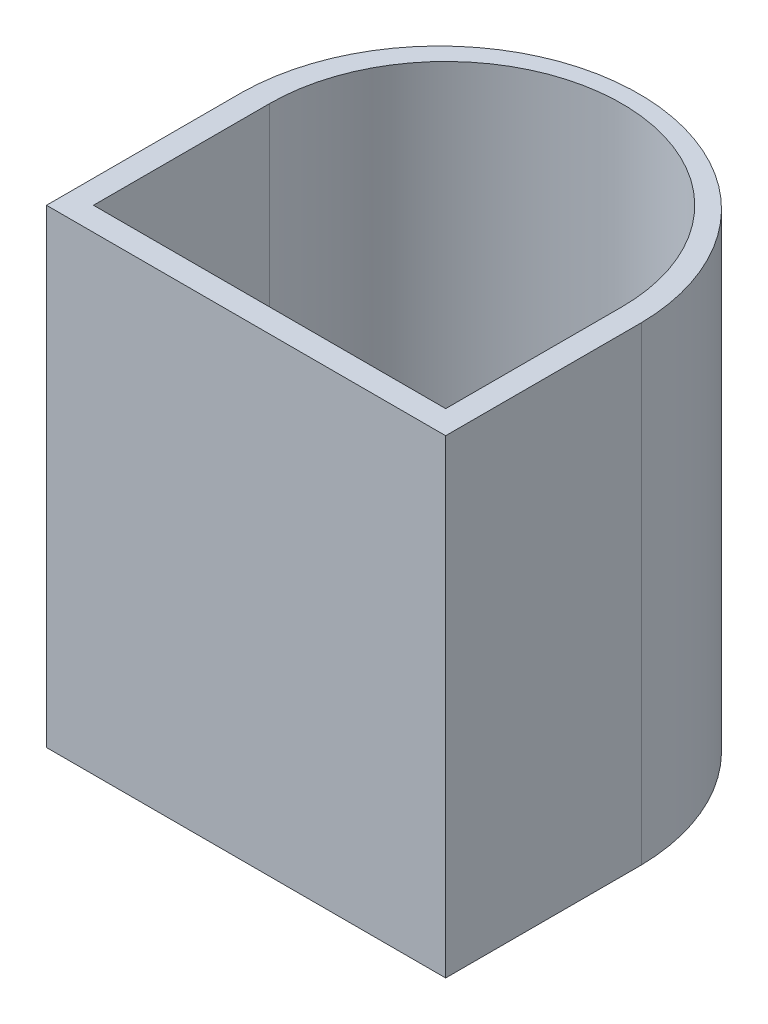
ISO-10303-21;
HEADER;
FILE_DESCRIPTION(('STEP AP214'),'2;1');
FILE_NAME('part.step','',(''),(''),'','','');
FILE_SCHEMA(('AUTOMOTIVE_DESIGN { 1 0 10303 214 1 1 1 1 }'));
ENDSEC;
DATA;
#1=APPLICATION_CONTEXT('core data for automotive mechanical design processes');
#2=APPLICATION_PROTOCOL_DEFINITION('international standard','automotive_design',2000,#1);
#3=PRODUCT_CONTEXT('',#1,'mechanical');
#4=PRODUCT('Part','Part','',(#3));
#5=PRODUCT_RELATED_PRODUCT_CATEGORY('part','',(#4));
#6=PRODUCT_DEFINITION_FORMATION('','',#4);
#7=PRODUCT_DEFINITION_CONTEXT('part definition',#1,'design');
#8=PRODUCT_DEFINITION('design','',#6,#7);
#9=PRODUCT_DEFINITION_SHAPE('','',#8);
#10=(LENGTH_UNIT() NAMED_UNIT(*) SI_UNIT(.MILLI.,.METRE.));
#11=(NAMED_UNIT(*) PLANE_ANGLE_UNIT() SI_UNIT($,.RADIAN.));
#12=(NAMED_UNIT(*) SI_UNIT($,.STERADIAN.) SOLID_ANGLE_UNIT());
#13=UNCERTAINTY_MEASURE_WITH_UNIT(LENGTH_MEASURE(1.E-05),#10,'distance_accuracy_value','');
#14=(GEOMETRIC_REPRESENTATION_CONTEXT(3) GLOBAL_UNCERTAINTY_ASSIGNED_CONTEXT((#13)) GLOBAL_UNIT_ASSIGNED_CONTEXT((#10,
#11,#12)) REPRESENTATION_CONTEXT('',''));
#15=CARTESIAN_POINT('',(0.,0.,0.));
#16=DIRECTION('',(0.,0.,1.));
#17=DIRECTION('',(1.,0.,0.));
#18=AXIS2_PLACEMENT_3D('',#15,#16,#17);
#19=CARTESIAN_POINT('',(14.998515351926,-2.,-14.4524035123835));
#20=DIRECTION('',(0.,1.,0.));
#21=DIRECTION('',(0.,0.,1.));
#22=AXIS2_PLACEMENT_3D('',#19,#20,#21);
#23=CYLINDRICAL_SURFACE('',#22,17.);
#24=DIRECTION('',(0.,1.,0.));
#25=VECTOR('',#24,1.);
#26=CARTESIAN_POINT('',(-2.,-2.,-14.6770717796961));
#27=LINE('',#26,#25);
#28=CARTESIAN_POINT('',(-2.,-2.,-14.6770717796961));
#29=VERTEX_POINT('',#28);
#30=CARTESIAN_POINT('',(-2.,38.,-14.6770717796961));
#31=VERTEX_POINT('',#30);
#32=EDGE_CURVE('E37',#29,#31,#27,.T.);
#33=ORIENTED_EDGE('',*,*,#32,.T.);
#34=CARTESIAN_POINT('',(14.998515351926,38.,-14.4524035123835));
#35=DIRECTION('',(0.,1.,0.));
#36=DIRECTION('',(0.,0.,1.));
#37=AXIS2_PLACEMENT_3D('',#34,#35,#36);
#38=CIRCLE('',#37,17.);
#39=CARTESIAN_POINT('',(31.9970307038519,38.,-14.6770717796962));
#40=VERTEX_POINT('',#39);
#41=EDGE_CURVE('E191',#31,#40,#38,.F.);
#42=ORIENTED_EDGE('',*,*,#41,.T.);
#43=DIRECTION('',(0.,1.,0.));
#44=VECTOR('',#43,1.);
#45=CARTESIAN_POINT('',(31.9970307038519,-2.,-14.6770717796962));
#46=LINE('',#45,#44);
#47=CARTESIAN_POINT('',(31.9970307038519,-2.,-14.6770717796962));
#48=VERTEX_POINT('',#47);
#49=EDGE_CURVE('E11',#48,#40,#46,.T.);
#50=ORIENTED_EDGE('',*,*,#49,.F.);
#51=CARTESIAN_POINT('',(14.998515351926,-2.,-14.4524035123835));
#52=DIRECTION('',(0.,1.,0.));
#53=DIRECTION('',(0.,0.,1.));
#54=AXIS2_PLACEMENT_3D('',#51,#52,#53);
#55=CIRCLE('',#54,17.);
#56=EDGE_CURVE('E203',#29,#48,#55,.F.);
#57=ORIENTED_EDGE('',*,*,#56,.F.);
#58=EDGE_LOOP('',(#33,#42,#50,#57));
#59=FACE_BOUND('',#58,.T.);
#60=ADVANCED_FACE('F34',(#59),#23,.T.);
#61=CARTESIAN_POINT('',(31.9970307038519,-2.,0.));
#62=DIRECTION('',(1.,0.,0.));
#63=DIRECTION('',(0.,0.,-1.));
#64=AXIS2_PLACEMENT_3D('',#61,#62,#63);
#65=PLANE('',#64);
#66=ORIENTED_EDGE('',*,*,#49,.T.);
#67=DIRECTION('',(0.,0.,-1.));
#68=VECTOR('',#67,1.);
#69=CARTESIAN_POINT('',(31.9970307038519,38.,0.));
#70=LINE('',#69,#68);
#71=CARTESIAN_POINT('',(31.9970307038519,38.,2.));
#72=VERTEX_POINT('',#71);
#73=EDGE_CURVE('E200',#72,#40,#70,.T.);
#74=ORIENTED_EDGE('',*,*,#73,.F.);
#75=DIRECTION('',(0.,1.,0.));
#76=VECTOR('',#75,1.);
#77=CARTESIAN_POINT('',(31.9970307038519,-2.,2.));
#78=LINE('',#77,#76);
#79=CARTESIAN_POINT('',(31.9970307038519,-2.,2.));
#80=VERTEX_POINT('',#79);
#81=EDGE_CURVE('E42',#80,#72,#78,.T.);
#82=ORIENTED_EDGE('',*,*,#81,.F.);
#83=DIRECTION('',(0.,0.,-1.));
#84=VECTOR('',#83,1.);
#85=CARTESIAN_POINT('',(31.9970307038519,-2.,0.));
#86=LINE('',#85,#84);
#87=EDGE_CURVE('E211',#80,#48,#86,.T.);
#88=ORIENTED_EDGE('',*,*,#87,.T.);
#89=EDGE_LOOP('',(#66,#74,#82,#88));
#90=FACE_BOUND('',#89,.T.);
#91=ADVANCED_FACE('F228',(#90),#65,.T.);
#92=CARTESIAN_POINT('',(0.,-2.,2.));
#93=DIRECTION('',(0.,0.,1.));
#94=DIRECTION('',(1.,0.,0.));
#95=AXIS2_PLACEMENT_3D('',#92,#93,#94);
#96=PLANE('',#95);
#97=ORIENTED_EDGE('',*,*,#81,.T.);
#98=DIRECTION('',(1.,0.,0.));
#99=VECTOR('',#98,1.);
#100=CARTESIAN_POINT('',(0.,38.,2.));
#101=LINE('',#100,#99);
#102=CARTESIAN_POINT('',(-2.,38.,2.));
#103=VERTEX_POINT('',#102);
#104=EDGE_CURVE('E197',#103,#72,#101,.T.);
#105=ORIENTED_EDGE('',*,*,#104,.F.);
#106=DIRECTION('',(0.,1.,0.));
#107=VECTOR('',#106,1.);
#108=CARTESIAN_POINT('',(-2.,-2.,2.));
#109=LINE('',#108,#107);
#110=CARTESIAN_POINT('',(-2.,-2.,2.));
#111=VERTEX_POINT('',#110);
#112=EDGE_CURVE('E214',#111,#103,#109,.T.);
#113=ORIENTED_EDGE('',*,*,#112,.F.);
#114=DIRECTION('',(1.,0.,0.));
#115=VECTOR('',#114,1.);
#116=CARTESIAN_POINT('',(0.,-2.,2.));
#117=LINE('',#116,#115);
#118=EDGE_CURVE('E208',#111,#80,#117,.T.);
#119=ORIENTED_EDGE('',*,*,#118,.T.);
#120=EDGE_LOOP('',(#97,#105,#113,#119));
#121=FACE_BOUND('',#120,.T.);
#122=ADVANCED_FACE('F232',(#121),#96,.T.);
#123=CARTESIAN_POINT('',(-2.,-2.,0.));
#124=DIRECTION('',(-1.,0.,0.));
#125=DIRECTION('',(0.,0.,1.));
#126=AXIS2_PLACEMENT_3D('',#123,#124,#125);
#127=PLANE('',#126);
#128=ORIENTED_EDGE('',*,*,#112,.T.);
#129=DIRECTION('',(0.,0.,1.));
#130=VECTOR('',#129,1.);
#131=CARTESIAN_POINT('',(-2.,38.,0.));
#132=LINE('',#131,#130);
#133=EDGE_CURVE('E194',#31,#103,#132,.T.);
#134=ORIENTED_EDGE('',*,*,#133,.F.);
#135=ORIENTED_EDGE('',*,*,#32,.F.);
#136=DIRECTION('',(0.,0.,1.));
#137=VECTOR('',#136,1.);
#138=CARTESIAN_POINT('',(-2.,-2.,0.));
#139=LINE('',#138,#137);
#140=EDGE_CURVE('E205',#29,#111,#139,.T.);
#141=ORIENTED_EDGE('',*,*,#140,.T.);
#142=EDGE_LOOP('',(#128,#134,#135,#141));
#143=FACE_BOUND('',#142,.T.);
#144=ADVANCED_FACE('F222',(#143),#127,.T.);
#145=CARTESIAN_POINT('',(0.,-2.,0.));
#146=DIRECTION('',(0.,1.,0.));
#147=DIRECTION('',(0.,0.,1.));
#148=AXIS2_PLACEMENT_3D('',#145,#146,#147);
#149=PLANE('',#148);
#150=DIRECTION('',(-1.,0.,0.));
#151=VECTOR('',#150,1.);
#152=CARTESIAN_POINT('',(6.00000000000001,-2.,-21.));
#153=LINE('',#152,#151);
#154=CARTESIAN_POINT('',(24.,-2.,-21.));
#155=VERTEX_POINT('',#154);
#156=CARTESIAN_POINT('',(6.00000000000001,-2.,-21.));
#157=VERTEX_POINT('',#156);
#158=EDGE_CURVE('E134',#155,#157,#153,.T.);
#159=ORIENTED_EDGE('',*,*,#158,.T.);
#160=DIRECTION('',(0.,0.,1.));
#161=VECTOR('',#160,1.);
#162=CARTESIAN_POINT('',(6.00000000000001,-2.,-9.));
#163=LINE('',#162,#161);
#164=CARTESIAN_POINT('',(6.00000000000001,-2.,-9.));
#165=VERTEX_POINT('',#164);
#166=EDGE_CURVE('E126',#157,#165,#163,.T.);
#167=ORIENTED_EDGE('',*,*,#166,.T.);
#168=DIRECTION('',(1.,0.,0.));
#169=VECTOR('',#168,1.);
#170=CARTESIAN_POINT('',(6.00000000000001,-2.,-9.));
#171=LINE('',#170,#169);
#172=CARTESIAN_POINT('',(24.,-2.,-9.));
#173=VERTEX_POINT('',#172);
#174=EDGE_CURVE('E137',#165,#173,#171,.T.);
#175=ORIENTED_EDGE('',*,*,#174,.T.);
#176=DIRECTION('',(0.,0.,-1.));
#177=VECTOR('',#176,1.);
#178=CARTESIAN_POINT('',(24.,-2.,-9.));
#179=LINE('',#178,#177);
#180=EDGE_CURVE('E55',#173,#155,#179,.T.);
#181=ORIENTED_EDGE('',*,*,#180,.T.);
#182=EDGE_LOOP('',(#159,#167,#175,#181));
#183=FACE_BOUND('',#182,.T.);
#184=ORIENTED_EDGE('',*,*,#56,.T.);
#185=ORIENTED_EDGE('',*,*,#87,.F.);
#186=ORIENTED_EDGE('',*,*,#118,.F.);
#187=ORIENTED_EDGE('',*,*,#140,.F.);
#188=EDGE_LOOP('',(#184,#185,#186,#187));
#189=FACE_BOUND('',#188,.T.);
#190=ADVANCED_FACE('F141',(#183,#189),#149,.F.);
#191=CARTESIAN_POINT('',(0.,38.,0.));
#192=DIRECTION('',(0.,1.,0.));
#193=DIRECTION('',(0.,0.,1.));
#194=AXIS2_PLACEMENT_3D('',#191,#192,#193);
#195=PLANE('',#194);
#196=CARTESIAN_POINT('',(15.,38.,-15.));
#197=DIRECTION('',(0.,1.,0.));
#198=DIRECTION('',(0.,0.,1.));
#199=AXIS2_PLACEMENT_3D('',#196,#197,#198);
#200=CIRCLE('',#199,15.);
#201=CARTESIAN_POINT('',(0.,38.,-15.));
#202=VERTEX_POINT('',#201);
#203=CARTESIAN_POINT('',(30.,38.,-15.));
#204=VERTEX_POINT('',#203);
#205=EDGE_CURVE('E161',#202,#204,#200,.F.);
#206=ORIENTED_EDGE('',*,*,#205,.T.);
#207=DIRECTION('',(0.,0.,-1.));
#208=VECTOR('',#207,1.);
#209=CARTESIAN_POINT('',(30.,38.,0.));
#210=LINE('',#209,#208);
#211=CARTESIAN_POINT('',(30.,38.,0.));
#212=VERTEX_POINT('',#211);
#213=EDGE_CURVE('E171',#212,#204,#210,.T.);
#214=ORIENTED_EDGE('',*,*,#213,.F.);
#215=DIRECTION('',(1.,0.,0.));
#216=VECTOR('',#215,1.);
#217=CARTESIAN_POINT('',(0.,38.,0.));
#218=LINE('',#217,#216);
#219=CARTESIAN_POINT('',(0.,38.,0.));
#220=VERTEX_POINT('',#219);
#221=EDGE_CURVE('E168',#220,#212,#218,.T.);
#222=ORIENTED_EDGE('',*,*,#221,.F.);
#223=DIRECTION('',(0.,0.,-1.));
#224=VECTOR('',#223,1.);
#225=CARTESIAN_POINT('',(0.,38.,0.));
#226=LINE('',#225,#224);
#227=EDGE_CURVE('E164',#220,#202,#226,.T.);
#228=ORIENTED_EDGE('',*,*,#227,.T.);
#229=EDGE_LOOP('',(#206,#214,#222,#228));
#230=FACE_BOUND('',#229,.T.);
#231=ORIENTED_EDGE('',*,*,#41,.F.);
#232=ORIENTED_EDGE('',*,*,#133,.T.);
#233=ORIENTED_EDGE('',*,*,#104,.T.);
#234=ORIENTED_EDGE('',*,*,#73,.T.);
#235=EDGE_LOOP('',(#231,#232,#233,#234));
#236=FACE_BOUND('',#235,.T.);
#237=ADVANCED_FACE('F225',(#230,#236),#195,.T.);
#238=CARTESIAN_POINT('',(15.,38.,-15.));
#239=DIRECTION('',(0.,-1.,0.));
#240=DIRECTION('',(0.,0.,-1.));
#241=AXIS2_PLACEMENT_3D('',#238,#239,#240);
#242=CYLINDRICAL_SURFACE('',#241,15.);
#243=CARTESIAN_POINT('',(15.,0.,-15.));
#244=DIRECTION('',(0.,1.,0.));
#245=DIRECTION('',(0.,0.,1.));
#246=AXIS2_PLACEMENT_3D('',#243,#244,#245);
#247=CIRCLE('',#246,15.);
#248=CARTESIAN_POINT('',(0.,0.,-15.));
#249=VERTEX_POINT('',#248);
#250=CARTESIAN_POINT('',(30.,0.,-15.));
#251=VERTEX_POINT('',#250);
#252=EDGE_CURVE('E157',#249,#251,#247,.F.);
#253=ORIENTED_EDGE('',*,*,#252,.T.);
#254=DIRECTION('',(0.,-1.,0.));
#255=VECTOR('',#254,1.);
#256=CARTESIAN_POINT('',(30.,38.,-15.));
#257=LINE('',#256,#255);
#258=EDGE_CURVE('E173',#204,#251,#257,.T.);
#259=ORIENTED_EDGE('',*,*,#258,.F.);
#260=ORIENTED_EDGE('',*,*,#205,.F.);
#261=DIRECTION('',(0.,-1.,0.));
#262=VECTOR('',#261,1.);
#263=CARTESIAN_POINT('',(0.,38.,-15.));
#264=LINE('',#263,#262);
#265=EDGE_CURVE('E189',#202,#249,#264,.T.);
#266=ORIENTED_EDGE('',*,*,#265,.T.);
#267=EDGE_LOOP('',(#253,#259,#260,#266));
#268=FACE_BOUND('',#267,.T.);
#269=ADVANCED_FACE('F268',(#268),#242,.F.);
#270=CARTESIAN_POINT('',(0.,38.,0.));
#271=DIRECTION('',(-1.,0.,0.));
#272=DIRECTION('',(0.,0.,1.));
#273=AXIS2_PLACEMENT_3D('',#270,#271,#272);
#274=PLANE('',#273);
#275=DIRECTION('',(0.,0.,-1.));
#276=VECTOR('',#275,1.);
#277=CARTESIAN_POINT('',(0.,0.,0.));
#278=LINE('',#277,#276);
#279=CARTESIAN_POINT('',(0.,0.,0.));
#280=VERTEX_POINT('',#279);
#281=EDGE_CURVE('E176',#280,#249,#278,.T.);
#282=ORIENTED_EDGE('',*,*,#281,.T.);
#283=ORIENTED_EDGE('',*,*,#265,.F.);
#284=ORIENTED_EDGE('',*,*,#227,.F.);
#285=DIRECTION('',(0.,-1.,0.));
#286=VECTOR('',#285,1.);
#287=CARTESIAN_POINT('',(0.,38.,0.));
#288=LINE('',#287,#286);
#289=EDGE_CURVE('E187',#220,#280,#288,.T.);
#290=ORIENTED_EDGE('',*,*,#289,.T.);
#291=EDGE_LOOP('',(#282,#283,#284,#290));
#292=FACE_BOUND('',#291,.T.);
#293=ADVANCED_FACE('F278',(#292),#274,.F.);
#294=CARTESIAN_POINT('',(0.,38.,0.));
#295=DIRECTION('',(0.,0.,-1.));
#296=DIRECTION('',(-1.,0.,0.));
#297=AXIS2_PLACEMENT_3D('',#294,#295,#296);
#298=PLANE('',#297);
#299=DIRECTION('',(1.,0.,0.));
#300=VECTOR('',#299,1.);
#301=CARTESIAN_POINT('',(0.,0.,0.));
#302=LINE('',#301,#300);
#303=CARTESIAN_POINT('',(30.,0.,0.));
#304=VERTEX_POINT('',#303);
#305=EDGE_CURVE('E179',#280,#304,#302,.T.);
#306=ORIENTED_EDGE('',*,*,#305,.F.);
#307=ORIENTED_EDGE('',*,*,#289,.F.);
#308=ORIENTED_EDGE('',*,*,#221,.T.);
#309=DIRECTION('',(0.,-1.,0.));
#310=VECTOR('',#309,1.);
#311=CARTESIAN_POINT('',(30.,38.,0.));
#312=LINE('',#311,#310);
#313=EDGE_CURVE('E184',#212,#304,#312,.T.);
#314=ORIENTED_EDGE('',*,*,#313,.T.);
#315=EDGE_LOOP('',(#306,#307,#308,#314));
#316=FACE_BOUND('',#315,.T.);
#317=ADVANCED_FACE('F288',(#316),#298,.T.);
#318=CARTESIAN_POINT('',(30.,38.,0.));
#319=DIRECTION('',(-1.,0.,0.));
#320=DIRECTION('',(0.,0.,1.));
#321=AXIS2_PLACEMENT_3D('',#318,#319,#320);
#322=PLANE('',#321);
#323=DIRECTION('',(0.,0.,-1.));
#324=VECTOR('',#323,1.);
#325=CARTESIAN_POINT('',(30.,0.,0.));
#326=LINE('',#325,#324);
#327=EDGE_CURVE('E165',#304,#251,#326,.T.);
#328=ORIENTED_EDGE('',*,*,#327,.F.);
#329=ORIENTED_EDGE('',*,*,#313,.F.);
#330=ORIENTED_EDGE('',*,*,#213,.T.);
#331=ORIENTED_EDGE('',*,*,#258,.T.);
#332=EDGE_LOOP('',(#328,#329,#330,#331));
#333=FACE_BOUND('',#332,.T.);
#334=ADVANCED_FACE('F298',(#333),#322,.T.);
#335=CARTESIAN_POINT('',(0.,0.,0.));
#336=DIRECTION('',(0.,1.,0.));
#337=DIRECTION('',(0.,0.,1.));
#338=AXIS2_PLACEMENT_3D('',#335,#336,#337);
#339=PLANE('',#338);
#340=DIRECTION('',(0.,0.,1.));
#341=VECTOR('',#340,1.);
#342=CARTESIAN_POINT('',(6.00000000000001,0.,-9.));
#343=LINE('',#342,#341);
#344=CARTESIAN_POINT('',(6.00000000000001,0.,-21.));
#345=VERTEX_POINT('',#344);
#346=CARTESIAN_POINT('',(6.00000000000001,0.,-9.));
#347=VERTEX_POINT('',#346);
#348=EDGE_CURVE('E129',#345,#347,#343,.T.);
#349=ORIENTED_EDGE('',*,*,#348,.F.);
#350=DIRECTION('',(-1.,0.,0.));
#351=VECTOR('',#350,1.);
#352=CARTESIAN_POINT('',(6.00000000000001,0.,-21.));
#353=LINE('',#352,#351);
#354=CARTESIAN_POINT('',(24.,0.,-21.));
#355=VERTEX_POINT('',#354);
#356=EDGE_CURVE('E144',#355,#345,#353,.T.);
#357=ORIENTED_EDGE('',*,*,#356,.F.);
#358=DIRECTION('',(0.,0.,-1.));
#359=VECTOR('',#358,1.);
#360=CARTESIAN_POINT('',(24.,0.,-9.));
#361=LINE('',#360,#359);
#362=CARTESIAN_POINT('',(24.,0.,-9.));
#363=VERTEX_POINT('',#362);
#364=EDGE_CURVE('E50',#363,#355,#361,.T.);
#365=ORIENTED_EDGE('',*,*,#364,.F.);
#366=DIRECTION('',(1.,0.,0.));
#367=VECTOR('',#366,1.);
#368=CARTESIAN_POINT('',(6.00000000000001,0.,-9.));
#369=LINE('',#368,#367);
#370=EDGE_CURVE('E152',#347,#363,#369,.T.);
#371=ORIENTED_EDGE('',*,*,#370,.F.);
#372=EDGE_LOOP('',(#349,#357,#365,#371));
#373=FACE_BOUND('',#372,.T.);
#374=ORIENTED_EDGE('',*,*,#252,.F.);
#375=ORIENTED_EDGE('',*,*,#281,.F.);
#376=ORIENTED_EDGE('',*,*,#305,.T.);
#377=ORIENTED_EDGE('',*,*,#327,.T.);
#378=EDGE_LOOP('',(#374,#375,#376,#377));
#379=FACE_BOUND('',#378,.T.);
#380=ADVANCED_FACE('F308',(#373,#379),#339,.T.);
#381=CARTESIAN_POINT('',(6.00000000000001,-2.,-9.));
#382=DIRECTION('',(-1.,0.,0.));
#383=DIRECTION('',(0.,0.,1.));
#384=AXIS2_PLACEMENT_3D('',#381,#382,#383);
#385=PLANE('',#384);
#386=ORIENTED_EDGE('',*,*,#348,.T.);
#387=DIRECTION('',(0.,1.,0.));
#388=VECTOR('',#387,1.);
#389=CARTESIAN_POINT('',(6.00000000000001,-2.,-9.));
#390=LINE('',#389,#388);
#391=EDGE_CURVE('E122',#165,#347,#390,.T.);
#392=ORIENTED_EDGE('',*,*,#391,.F.);
#393=ORIENTED_EDGE('',*,*,#166,.F.);
#394=DIRECTION('',(0.,1.,0.));
#395=VECTOR('',#394,1.);
#396=CARTESIAN_POINT('',(6.00000000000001,-2.,-21.));
#397=LINE('',#396,#395);
#398=EDGE_CURVE('E155',#157,#345,#397,.T.);
#399=ORIENTED_EDGE('',*,*,#398,.T.);
#400=EDGE_LOOP('',(#386,#392,#393,#399));
#401=FACE_BOUND('',#400,.T.);
#402=ADVANCED_FACE('F124',(#401),#385,.F.);
#403=CARTESIAN_POINT('',(6.00000000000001,-2.,-21.));
#404=DIRECTION('',(0.,0.,-1.));
#405=DIRECTION('',(-1.,0.,0.));
#406=AXIS2_PLACEMENT_3D('',#403,#404,#405);
#407=PLANE('',#406);
#408=ORIENTED_EDGE('',*,*,#356,.T.);
#409=ORIENTED_EDGE('',*,*,#398,.F.);
#410=ORIENTED_EDGE('',*,*,#158,.F.);
#411=DIRECTION('',(0.,1.,0.));
#412=VECTOR('',#411,1.);
#413=CARTESIAN_POINT('',(24.,-2.,-21.));
#414=LINE('',#413,#412);
#415=EDGE_CURVE('E158',#155,#355,#414,.T.);
#416=ORIENTED_EDGE('',*,*,#415,.T.);
#417=EDGE_LOOP('',(#408,#409,#410,#416));
#418=FACE_BOUND('',#417,.T.);
#419=ADVANCED_FACE('F333',(#418),#407,.F.);
#420=CARTESIAN_POINT('',(24.,-2.,-9.));
#421=DIRECTION('',(1.,0.,0.));
#422=DIRECTION('',(0.,0.,-1.));
#423=AXIS2_PLACEMENT_3D('',#420,#421,#422);
#424=PLANE('',#423);
#425=ORIENTED_EDGE('',*,*,#364,.T.);
#426=ORIENTED_EDGE('',*,*,#415,.F.);
#427=ORIENTED_EDGE('',*,*,#180,.F.);
#428=DIRECTION('',(0.,1.,0.));
#429=VECTOR('',#428,1.);
#430=CARTESIAN_POINT('',(24.,-2.,-9.));
#431=LINE('',#430,#429);
#432=EDGE_CURVE('E133',#173,#363,#431,.T.);
#433=ORIENTED_EDGE('',*,*,#432,.T.);
#434=EDGE_LOOP('',(#425,#426,#427,#433));
#435=FACE_BOUND('',#434,.T.);
#436=ADVANCED_FACE('F342',(#435),#424,.F.);
#437=CARTESIAN_POINT('',(6.00000000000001,-2.,-9.));
#438=DIRECTION('',(0.,0.,1.));
#439=DIRECTION('',(1.,0.,0.));
#440=AXIS2_PLACEMENT_3D('',#437,#438,#439);
#441=PLANE('',#440);
#442=ORIENTED_EDGE('',*,*,#370,.T.);
#443=ORIENTED_EDGE('',*,*,#432,.F.);
#444=ORIENTED_EDGE('',*,*,#174,.F.);
#445=ORIENTED_EDGE('',*,*,#391,.T.);
#446=EDGE_LOOP('',(#442,#443,#444,#445));
#447=FACE_BOUND('',#446,.T.);
#448=ADVANCED_FACE('F138',(#447),#441,.F.);
#449=CLOSED_SHELL('',(#60,#91,#122,#144,#190,#237,#269,#293,#317,#334,#380,#402,#419,#436,#448));
#450=MANIFOLD_SOLID_BREP('B2',#449);
#451=ADVANCED_BREP_SHAPE_REPRESENTATION('',(#18,#450),#14);
#452=SHAPE_DEFINITION_REPRESENTATION(#9,#451);
ENDSEC;
END-ISO-10303-21;
